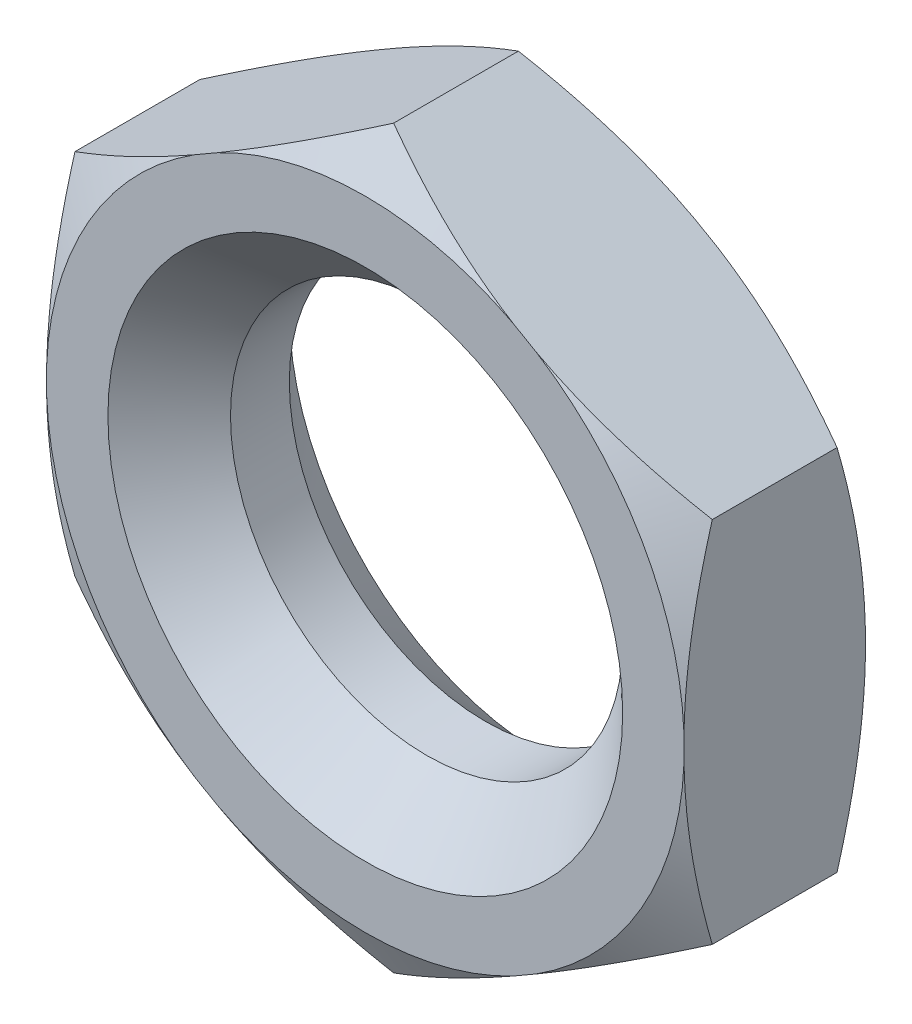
from build123d import *

# Parameters (mm, degrees)
BOSS_EXTRUDE1_DEPTH = 1.85
SKETCH6_R           = 4
CUT_EXTRUDE1_DEPTH  = 3.7
CHAMFER1_SIZE       = 1.25


with BuildPart() as part:
    # Sketch3 → Boss-Extrude1 (new, symmetric)
    with BuildSketch(Plane.XY):
        Polygon((0, 7.505553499), (-6.5, 3.75277675), (-6.5, -3.75277675), (0, -7.505553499), (6.5, -3.75277675), (6.5, 3.75277675), align=None)
    extrude(amount=BOSS_EXTRUDE1_DEPTH, both=True)

    # Sketch5 → Cut-Revolve1 (revolve, cut)
    with BuildSketch(Plane(origin=(0, 0, 0), x_dir=(0, 0, -1), z_dir=(1, 0, 0))):
        Polygon((-1.85, 7.505553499), (-1.85, 6.505553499), (-1.272649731, 7.505553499), align=None)
    cut_revolve1 = revolve(axis=Axis((0, 0, 5.457798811), (0, 0, -1)), mode=Mode.SUBTRACT)

    # Mirror1: Cut-Revolve1 across plane
    add(cut_revolve1.mirror(Plane.XY), mode=Mode.SUBTRACT)

    # Sketch6 → Cut-Extrude1 (cut)
    with BuildSketch(Plane.XY.offset(1.85)):
        Circle(SKETCH6_R)
    extrude(amount=-CUT_EXTRUDE1_DEPTH, mode=Mode.SUBTRACT)

    # Chamfer1
    chamfer1_edges = [part.edges().sort_by_distance(p)[0] for p in [
        (-4, 0, -1.85),
        (-4, 0, 1.85),
    ]]
    chamfer(chamfer1_edges, length=CHAMFER1_SIZE)


solid = part.part
